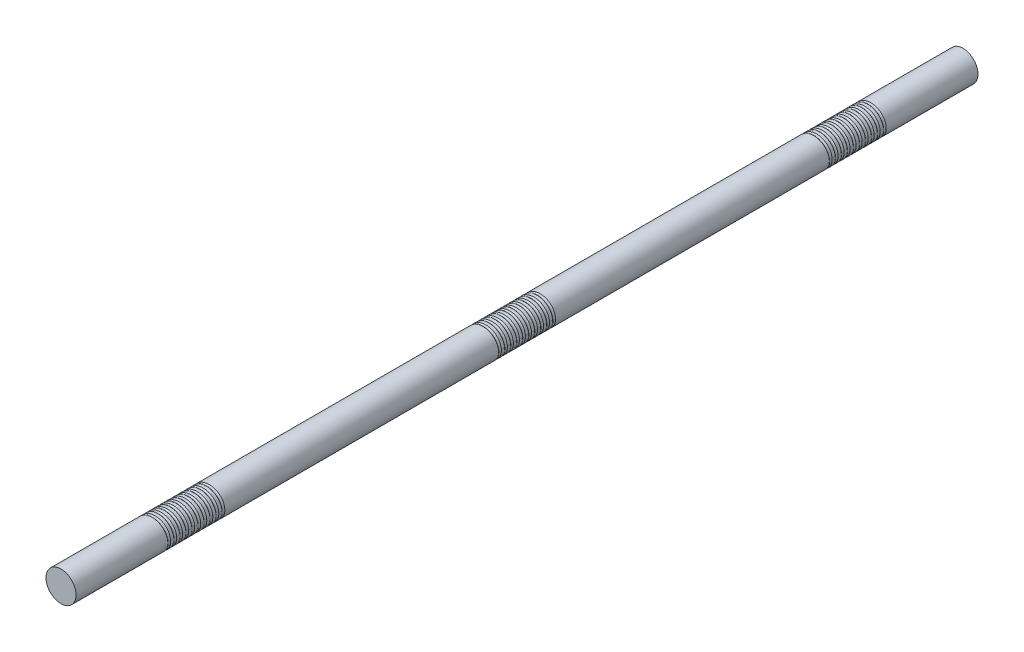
from build123d import *

# Parameters (mm, degrees)
SKETCH1_R              = 25
BOSS_EXTRUDE1_DEPTH    = 1500
CUT_SWEEP1_PITCH       = 10
CUT_SWEEP1_HEIGHT      = 100
CUT_SWEEP1_RADIUS      = 27.116666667
CUT_SWEEP1_START_ANGLE = -180
SKETCH3_R              = 3.175
LPATTERN1_COUNT        = 3
LPATTERN1_PITCH        = 550


with BuildPart() as part:
    # Sketch1 → Boss-Extrude1 (new body)
    with BuildSketch(Plane.XY):
        Circle(SKETCH1_R)
    extrude(amount=BOSS_EXTRUDE1_DEPTH)

    # Cut-Sweep1: sweep along a helix
    with BuildLine() as cut_sweep1_path:
        add(Helix(CUT_SWEEP1_PITCH, CUT_SWEEP1_HEIGHT, CUT_SWEEP1_RADIUS, center=(0, 0, 150), direction=(0, 0, 1), mode=Mode.PRIVATE).rotate(Axis((0, 0, 150), (0, 0, 1)), CUT_SWEEP1_START_ANGLE))
    # Sketch3 → Cut-Sweep1 (sweep, cut)
    with BuildSketch(Plane(origin=(0, 0, 0), x_dir=(1, 0, 0), z_dir=(0, 1, 0))):
        with Locations((-27.116666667, -150)):
            Circle(SKETCH3_R)
    cut_sweep1 = sweep(path=cut_sweep1_path.line, is_frenet=True, mode=Mode.SUBTRACT)

    # LPattern1: Cut-Sweep1 ×3
    with Locations(*[(0, 0, i * LPATTERN1_PITCH) for i in range(1, LPATTERN1_COUNT)]):
        add(cut_sweep1, mode=Mode.SUBTRACT)


solid = part.part
